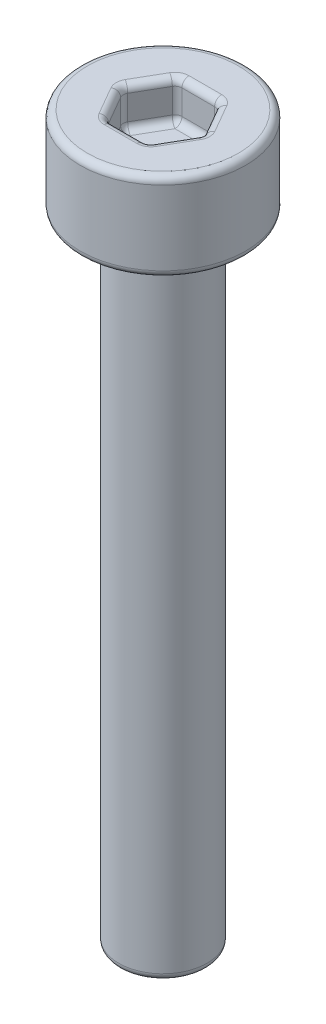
from build123d import *

# Parameters (mm, degrees)
SKETCH1_R           = 1.25
BOSS_EXTRUDE1_DEPTH = 18
SKETCH2_R           = 2.34
BOSS_EXTRUDE2_DEPTH = 2.5
CUT_EXTRUDE1_DEPTH  = 1.1
FILLET1_R           = 0.2


with BuildPart() as part:
    # Sketch1 → Boss-Extrude1 (new body)
    with BuildSketch(Plane(origin=(0, 0, 0), x_dir=(1, 0, 0), z_dir=(0, 1, 0))):
        with Locations(Location((0, 0, 0), (0, 0, 270))):
            Circle(SKETCH1_R)
    extrude(amount=-BOSS_EXTRUDE1_DEPTH)

    # Sketch2 → Boss-Extrude2 (add)
    with BuildSketch(Plane(origin=(0, 0, 0), x_dir=(1, 0, 0), z_dir=(0, 1, 0))):
        with Locations(Location((0, 0, 0), (0, 0, 270))):
            Circle(SKETCH2_R)
    extrude(amount=BOSS_EXTRUDE2_DEPTH)

    # Sketch3 → Cut-Extrude1 (cut)
    with BuildSketch(Plane(origin=(0, 2.5, 0), x_dir=(1, 0, 0), z_dir=(0, 1, 0))):
        Polygon((1.154700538, 0), (0.577350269, 1), (-0.577350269, 1), (-1.154700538, 0), (-0.577350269, -1), (0.577350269, -1), align=None)
    extrude(amount=-CUT_EXTRUDE1_DEPTH, mode=Mode.SUBTRACT)

    # Fillet1
    fillet1_edges = [part.edges().sort_by_distance(p)[0] for p in [
        (0.866025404, 1.4, 0.5),
        (1.154700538, 1.95, 0),
        (0, 1.4, 1),
        (0.577350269, 1.95, 1),
        (-0.866025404, 1.4, 0.5),
        (-0.577350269, 1.95, 1),
        (-0.866025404, 1.4, -0.5),
        (-1.154700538, 1.95, 0),
        (0, 1.4, -1),
        (-0.577350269, 1.95, -1),
        (0.866025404, 1.4, -0.5),
        (0.577350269, 1.95, -1),
        (0.866025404, 2.5, 0.5),
        (0.866025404, 2.5, -0.5),
        (0, 2.5, -1),
        (-0.866025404, 2.5, -0.5),
        (-0.866025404, 2.5, 0.5),
        (0, 2.5, 1),
        (0, -18, -1.25),
        (0, 0, -2.34),
        (0, 2.5, -2.34),
    ]]
    fillet(fillet1_edges, radius=FILLET1_R)


solid = part.part
